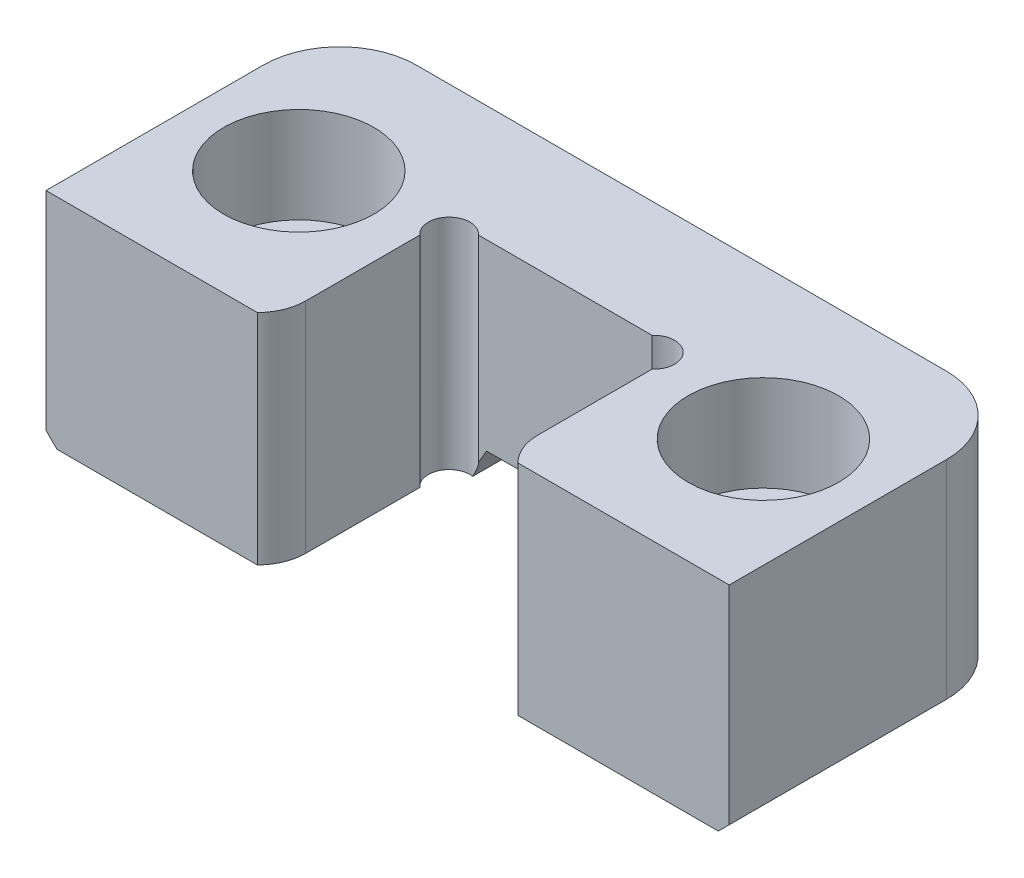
ISO-10303-21;
HEADER;
FILE_DESCRIPTION(('STEP AP214'),'2;1');
FILE_NAME('part.step','',(''),(''),'','','');
FILE_SCHEMA(('AUTOMOTIVE_DESIGN { 1 0 10303 214 1 1 1 1 }'));
ENDSEC;
DATA;
#1=APPLICATION_CONTEXT('core data for automotive mechanical design processes');
#2=APPLICATION_PROTOCOL_DEFINITION('international standard','automotive_design',2000,#1);
#3=PRODUCT_CONTEXT('',#1,'mechanical');
#4=PRODUCT('Part','Part','',(#3));
#5=PRODUCT_RELATED_PRODUCT_CATEGORY('part','',(#4));
#6=PRODUCT_DEFINITION_FORMATION('','',#4);
#7=PRODUCT_DEFINITION_CONTEXT('part definition',#1,'design');
#8=PRODUCT_DEFINITION('design','',#6,#7);
#9=PRODUCT_DEFINITION_SHAPE('','',#8);
#10=(LENGTH_UNIT() NAMED_UNIT(*) SI_UNIT(.MILLI.,.METRE.));
#11=(NAMED_UNIT(*) PLANE_ANGLE_UNIT() SI_UNIT($,.RADIAN.));
#12=(NAMED_UNIT(*) SI_UNIT($,.STERADIAN.) SOLID_ANGLE_UNIT());
#13=UNCERTAINTY_MEASURE_WITH_UNIT(LENGTH_MEASURE(1.E-05),#10,'distance_accuracy_value','');
#14=(GEOMETRIC_REPRESENTATION_CONTEXT(3) GLOBAL_UNCERTAINTY_ASSIGNED_CONTEXT((#13)) GLOBAL_UNIT_ASSIGNED_CONTEXT((#10,
#11,#12)) REPRESENTATION_CONTEXT('',''));
#15=CARTESIAN_POINT('',(0.,0.,0.));
#16=DIRECTION('',(0.,0.,1.));
#17=DIRECTION('',(1.,0.,0.));
#18=AXIS2_PLACEMENT_3D('',#15,#16,#17);
#19=CARTESIAN_POINT('',(-25.,-16.,-21.5));
#20=DIRECTION('',(0.,-1.,0.));
#21=DIRECTION('',(0.,0.,-1.));
#22=AXIS2_PLACEMENT_3D('',#19,#20,#21);
#23=PLANE('',#22);
#24=CARTESIAN_POINT('',(-17.,-16.,-10.5));
#25=DIRECTION('',(0.,1.,0.));
#26=DIRECTION('',(0.,0.,1.));
#27=AXIS2_PLACEMENT_3D('',#24,#25,#26);
#28=CIRCLE('',#27,3.3);
#29=CARTESIAN_POINT('',(-17.,-16.,-7.2));
#30=VERTEX_POINT('',#29);
#31=EDGE_CURVE('E203',#30,#30,#28,.T.);
#32=ORIENTED_EDGE('',*,*,#31,.T.);
#33=EDGE_LOOP('',(#32));
#34=FACE_BOUND('',#33,.T.);
#35=CARTESIAN_POINT('',(-19.4,-16.,-15.9));
#36=DIRECTION('',(0.,-1.,0.));
#37=DIRECTION('',(0.,0.,-1.));
#38=AXIS2_PLACEMENT_3D('',#35,#36,#37);
#39=CIRCLE('',#38,4.8);
#40=CARTESIAN_POINT('',(-24.2,-16.,-15.9));
#41=VERTEX_POINT('',#40);
#42=CARTESIAN_POINT('',(-19.4,-16.,-20.7));
#43=VERTEX_POINT('',#42);
#44=EDGE_CURVE('E344',#41,#43,#39,.T.);
#45=ORIENTED_EDGE('',*,*,#44,.T.);
#46=DIRECTION('',(1.,0.,0.));
#47=VECTOR('',#46,1.);
#48=CARTESIAN_POINT('',(-25.,-16.,-20.7));
#49=LINE('',#48,#47);
#50=CARTESIAN_POINT('',(-7.2679869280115,-16.,-20.7));
#51=VERTEX_POINT('',#50);
#52=EDGE_CURVE('E346',#43,#51,#49,.T.);
#53=ORIENTED_EDGE('',*,*,#52,.T.);
#54=DIRECTION('',(0.,0.,-1.));
#55=VECTOR('',#54,1.);
#56=CARTESIAN_POINT('',(-7.2679869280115,-16.,0.));
#57=LINE('',#56,#55);
#58=CARTESIAN_POINT('',(-7.2679869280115,-16.,-13.4938461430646));
#59=VERTEX_POINT('',#58);
#60=EDGE_CURVE('E223',#59,#51,#57,.T.);
#61=ORIENTED_EDGE('',*,*,#60,.F.);
#62=CARTESIAN_POINT('',(-7.489,-16.,-11.99));
#63=DIRECTION('',(0.,1.,0.));
#64=DIRECTION('',(0.,0.,1.));
#65=AXIS2_PLACEMENT_3D('',#62,#63,#64);
#66=CIRCLE('',#65,1.52);
#67=CARTESIAN_POINT('',(-8.499,-16.,-10.8540862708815));
#68=VERTEX_POINT('',#67);
#69=EDGE_CURVE('E242',#59,#68,#66,.T.);
#70=ORIENTED_EDGE('',*,*,#69,.T.);
#71=DIRECTION('',(0.,0.,-1.));
#72=VECTOR('',#71,1.);
#73=CARTESIAN_POINT('',(-8.499,-16.,0.));
#74=LINE('',#73,#72);
#75=CARTESIAN_POINT('',(-8.499,-16.,-2.5));
#76=VERTEX_POINT('',#75);
#77=EDGE_CURVE('E275',#76,#68,#74,.T.);
#78=ORIENTED_EDGE('',*,*,#77,.F.);
#79=CARTESIAN_POINT('',(-12.0293105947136,-16.,-2.5));
#80=DIRECTION('',(0.,-1.,0.));
#81=DIRECTION('',(0.,0.,1.));
#82=AXIS2_PLACEMENT_3D('',#79,#80,#81);
#83=CIRCLE('',#82,3.53031059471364);
#84=CARTESIAN_POINT('',(-9.53670294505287,-16.,0.));
#85=VERTEX_POINT('',#84);
#86=EDGE_CURVE('E251',#76,#85,#83,.T.);
#87=ORIENTED_EDGE('',*,*,#86,.T.);
#88=DIRECTION('',(1.,0.,0.));
#89=VECTOR('',#88,1.);
#90=CARTESIAN_POINT('',(-25.,-16.,0.));
#91=LINE('',#90,#89);
#92=CARTESIAN_POINT('',(-24.2,-16.,0.));
#93=VERTEX_POINT('',#92);
#94=EDGE_CURVE('E273',#93,#85,#91,.T.);
#95=ORIENTED_EDGE('',*,*,#94,.F.);
#96=DIRECTION('',(0.,0.,-1.));
#97=VECTOR('',#96,1.);
#98=CARTESIAN_POINT('',(-24.2,-16.,-21.5));
#99=LINE('',#98,#97);
#100=EDGE_CURVE('E342',#93,#41,#99,.T.);
#101=ORIENTED_EDGE('',*,*,#100,.T.);
#102=EDGE_LOOP('',(#45,#53,#61,#70,#78,#87,#95,#101));
#103=FACE_BOUND('',#102,.T.);
#104=ADVANCED_FACE('F35',(#34,#103),#23,.T.);
#105=CARTESIAN_POINT('',(-25.,-16.,0.));
#106=DIRECTION('',(-1.,0.,0.));
#107=DIRECTION('',(0.,0.,1.));
#108=AXIS2_PLACEMENT_3D('',#105,#106,#107);
#109=PLANE('',#108);
#110=DIRECTION('',(0.,1.,0.));
#111=VECTOR('',#110,1.);
#112=CARTESIAN_POINT('',(-25.,-16.,-15.9));
#113=LINE('',#112,#111);
#114=CARTESIAN_POINT('',(-25.,0.,-15.9));
#115=VERTEX_POINT('',#114);
#116=CARTESIAN_POINT('',(-25.,-15.2,-15.9));
#117=VERTEX_POINT('',#116);
#118=EDGE_CURVE('E318',#115,#117,#113,.F.);
#119=ORIENTED_EDGE('',*,*,#118,.T.);
#120=DIRECTION('',(0.,0.,1.));
#121=VECTOR('',#120,1.);
#122=CARTESIAN_POINT('',(-25.,-15.2,0.));
#123=LINE('',#122,#121);
#124=CARTESIAN_POINT('',(-25.,-15.2,0.));
#125=VERTEX_POINT('',#124);
#126=EDGE_CURVE('E351',#117,#125,#123,.T.);
#127=ORIENTED_EDGE('',*,*,#126,.T.);
#128=DIRECTION('',(0.,1.,0.));
#129=VECTOR('',#128,1.);
#130=CARTESIAN_POINT('',(-25.,-16.,0.));
#131=LINE('',#130,#129);
#132=CARTESIAN_POINT('',(-25.,0.,0.));
#133=VERTEX_POINT('',#132);
#134=EDGE_CURVE('E283',#125,#133,#131,.T.);
#135=ORIENTED_EDGE('',*,*,#134,.T.);
#136=DIRECTION('',(0.,0.,1.));
#137=VECTOR('',#136,1.);
#138=CARTESIAN_POINT('',(-25.,0.,0.));
#139=LINE('',#138,#137);
#140=EDGE_CURVE('E265',#115,#133,#139,.T.);
#141=ORIENTED_EDGE('',*,*,#140,.F.);
#142=EDGE_LOOP('',(#119,#127,#135,#141));
#143=FACE_BOUND('',#142,.T.);
#144=ADVANCED_FACE('F431',(#143),#109,.T.);
#145=CARTESIAN_POINT('',(-25.,-16.,-21.5));
#146=DIRECTION('',(0.,0.,-1.));
#147=DIRECTION('',(-1.,0.,0.));
#148=AXIS2_PLACEMENT_3D('',#145,#146,#147);
#149=PLANE('',#148);
#150=DIRECTION('',(0.499999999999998,0.86602540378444,0.));
#151=VECTOR('',#150,1.);
#152=CARTESIAN_POINT('',(-6.35,-14.41,-21.5));
#153=LINE('',#152,#151);
#154=CARTESIAN_POINT('',(-6.8061067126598,-15.2,-21.5));
#155=VERTEX_POINT('',#154);
#156=CARTESIAN_POINT('',(-6.35,-14.41,-21.5));
#157=VERTEX_POINT('',#156);
#158=EDGE_CURVE('E190',#155,#157,#153,.T.);
#159=ORIENTED_EDGE('',*,*,#158,.F.);
#160=DIRECTION('',(-1.,0.,0.));
#161=VECTOR('',#160,1.);
#162=CARTESIAN_POINT('',(-25.,-15.2,-21.5));
#163=LINE('',#162,#161);
#164=CARTESIAN_POINT('',(-19.4,-15.2,-21.5));
#165=VERTEX_POINT('',#164);
#166=EDGE_CURVE('E340',#155,#165,#163,.T.);
#167=ORIENTED_EDGE('',*,*,#166,.T.);
#168=DIRECTION('',(0.,1.,0.));
#169=VECTOR('',#168,1.);
#170=CARTESIAN_POINT('',(-19.4,-16.,-21.5));
#171=LINE('',#170,#169);
#172=CARTESIAN_POINT('',(-19.4,0.,-21.5));
#173=VERTEX_POINT('',#172);
#174=EDGE_CURVE('E313',#165,#173,#171,.T.);
#175=ORIENTED_EDGE('',*,*,#174,.T.);
#176=DIRECTION('',(-1.,0.,0.));
#177=VECTOR('',#176,1.);
#178=CARTESIAN_POINT('',(-25.,0.,-21.5));
#179=LINE('',#178,#177);
#180=CARTESIAN_POINT('',(19.4,0.,-21.5));
#181=VERTEX_POINT('',#180);
#182=EDGE_CURVE('E276',#181,#173,#179,.T.);
#183=ORIENTED_EDGE('',*,*,#182,.F.);
#184=DIRECTION('',(0.,1.,0.));
#185=VECTOR('',#184,1.);
#186=CARTESIAN_POINT('',(19.4,-16.,-21.5));
#187=LINE('',#186,#185);
#188=CARTESIAN_POINT('',(19.4,-15.2,-21.5));
#189=VERTEX_POINT('',#188);
#190=EDGE_CURVE('E315',#181,#189,#187,.F.);
#191=ORIENTED_EDGE('',*,*,#190,.T.);
#192=DIRECTION('',(-1.,0.,0.));
#193=VECTOR('',#192,1.);
#194=CARTESIAN_POINT('',(-25.,-15.2,-21.5));
#195=LINE('',#194,#193);
#196=CARTESIAN_POINT('',(6.8061067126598,-15.2,-21.5));
#197=VERTEX_POINT('',#196);
#198=EDGE_CURVE('E338',#189,#197,#195,.T.);
#199=ORIENTED_EDGE('',*,*,#198,.T.);
#200=DIRECTION('',(0.499999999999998,-0.86602540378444,0.));
#201=VECTOR('',#200,1.);
#202=CARTESIAN_POINT('',(6.35,-14.41,-21.5));
#203=LINE('',#202,#201);
#204=CARTESIAN_POINT('',(6.35,-14.41,-21.5));
#205=VERTEX_POINT('',#204);
#206=EDGE_CURVE('E214',#205,#197,#203,.T.);
#207=ORIENTED_EDGE('',*,*,#206,.F.);
#208=DIRECTION('',(1.,0.,0.));
#209=VECTOR('',#208,1.);
#210=CARTESIAN_POINT('',(6.35,-14.41,-21.5));
#211=LINE('',#210,#209);
#212=EDGE_CURVE('E202',#157,#205,#211,.T.);
#213=ORIENTED_EDGE('',*,*,#212,.F.);
#214=EDGE_LOOP('',(#159,#167,#175,#183,#191,#199,#207,#213));
#215=FACE_BOUND('',#214,.T.);
#216=ADVANCED_FACE('F216',(#215),#149,.T.);
#217=CARTESIAN_POINT('',(25.,-16.,0.));
#218=DIRECTION('',(1.,0.,0.));
#219=DIRECTION('',(0.,0.,-1.));
#220=AXIS2_PLACEMENT_3D('',#217,#218,#219);
#221=PLANE('',#220);
#222=DIRECTION('',(0.,1.,0.));
#223=VECTOR('',#222,1.);
#224=CARTESIAN_POINT('',(25.,-16.,0.));
#225=LINE('',#224,#223);
#226=CARTESIAN_POINT('',(25.,-15.2,0.));
#227=VERTEX_POINT('',#226);
#228=CARTESIAN_POINT('',(25.,0.,0.));
#229=VERTEX_POINT('',#228);
#230=EDGE_CURVE('E304',#227,#229,#225,.T.);
#231=ORIENTED_EDGE('',*,*,#230,.F.);
#232=DIRECTION('',(0.,0.,-1.));
#233=VECTOR('',#232,1.);
#234=CARTESIAN_POINT('',(25.,-15.2,0.));
#235=LINE('',#234,#233);
#236=CARTESIAN_POINT('',(25.,-15.2,-15.9));
#237=VERTEX_POINT('',#236);
#238=EDGE_CURVE('E44',#227,#237,#235,.T.);
#239=ORIENTED_EDGE('',*,*,#238,.T.);
#240=DIRECTION('',(0.,1.,0.));
#241=VECTOR('',#240,1.);
#242=CARTESIAN_POINT('',(25.,-16.,-15.9));
#243=LINE('',#242,#241);
#244=CARTESIAN_POINT('',(25.,0.,-15.9));
#245=VERTEX_POINT('',#244);
#246=EDGE_CURVE('E306',#237,#245,#243,.T.);
#247=ORIENTED_EDGE('',*,*,#246,.T.);
#248=DIRECTION('',(0.,0.,-1.));
#249=VECTOR('',#248,1.);
#250=CARTESIAN_POINT('',(25.,0.,0.));
#251=LINE('',#250,#249);
#252=EDGE_CURVE('E299',#229,#245,#251,.T.);
#253=ORIENTED_EDGE('',*,*,#252,.F.);
#254=EDGE_LOOP('',(#231,#239,#247,#253));
#255=FACE_BOUND('',#254,.T.);
#256=ADVANCED_FACE('F423',(#255),#221,.T.);
#257=CARTESIAN_POINT('',(8.499,-16.,0.));
#258=DIRECTION('',(0.,0.,1.));
#259=DIRECTION('',(1.,0.,0.));
#260=AXIS2_PLACEMENT_3D('',#257,#258,#259);
#261=PLANE('',#260);
#262=DIRECTION('',(1.,0.,0.));
#263=VECTOR('',#262,1.);
#264=CARTESIAN_POINT('',(8.499,-16.,0.));
#265=LINE('',#264,#263);
#266=CARTESIAN_POINT('',(9.53670294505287,-16.,0.));
#267=VERTEX_POINT('',#266);
#268=CARTESIAN_POINT('',(24.2,-16.,0.));
#269=VERTEX_POINT('',#268);
#270=EDGE_CURVE('E281',#267,#269,#265,.T.);
#271=ORIENTED_EDGE('',*,*,#270,.T.);
#272=DIRECTION('',(-0.707106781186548,-0.707106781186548,0.));
#273=VECTOR('',#272,1.);
#274=CARTESIAN_POINT('',(16.3495,-23.8505,0.));
#275=LINE('',#274,#273);
#276=EDGE_CURVE('E11',#269,#227,#275,.F.);
#277=ORIENTED_EDGE('',*,*,#276,.T.);
#278=ORIENTED_EDGE('',*,*,#230,.T.);
#279=DIRECTION('',(1.,0.,0.));
#280=VECTOR('',#279,1.);
#281=CARTESIAN_POINT('',(8.499,0.,0.));
#282=LINE('',#281,#280);
#283=CARTESIAN_POINT('',(9.53670294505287,0.,0.));
#284=VERTEX_POINT('',#283);
#285=EDGE_CURVE('E296',#284,#229,#282,.T.);
#286=ORIENTED_EDGE('',*,*,#285,.F.);
#287=DIRECTION('',(0.,1.,0.));
#288=VECTOR('',#287,1.);
#289=CARTESIAN_POINT('',(9.53670294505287,-16.,0.));
#290=LINE('',#289,#288);
#291=EDGE_CURVE('E269',#267,#284,#290,.T.);
#292=ORIENTED_EDGE('',*,*,#291,.F.);
#293=EDGE_LOOP('',(#271,#277,#278,#286,#292));
#294=FACE_BOUND('',#293,.T.);
#295=ADVANCED_FACE('F389',(#294),#261,.T.);
#296=CARTESIAN_POINT('',(8.499,-16.,0.));
#297=DIRECTION('',(-1.,0.,0.));
#298=DIRECTION('',(0.,0.,1.));
#299=AXIS2_PLACEMENT_3D('',#296,#297,#298);
#300=PLANE('',#299);
#301=DIRECTION('',(0.,1.,0.));
#302=VECTOR('',#301,1.);
#303=CARTESIAN_POINT('',(8.499,-16.,-10.8540862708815));
#304=LINE('',#303,#302);
#305=CARTESIAN_POINT('',(8.499,-16.,-10.8540862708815));
#306=VERTEX_POINT('',#305);
#307=CARTESIAN_POINT('',(8.499,0.,-10.8540862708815));
#308=VERTEX_POINT('',#307);
#309=EDGE_CURVE('E239',#306,#308,#304,.T.);
#310=ORIENTED_EDGE('',*,*,#309,.F.);
#311=DIRECTION('',(0.,0.,1.));
#312=VECTOR('',#311,1.);
#313=CARTESIAN_POINT('',(8.499,-16.,0.));
#314=LINE('',#313,#312);
#315=CARTESIAN_POINT('',(8.499,-16.,-2.5));
#316=VERTEX_POINT('',#315);
#317=EDGE_CURVE('E279',#306,#316,#314,.T.);
#318=ORIENTED_EDGE('',*,*,#317,.T.);
#319=DIRECTION('',(0.,1.,0.));
#320=VECTOR('',#319,1.);
#321=CARTESIAN_POINT('',(8.499,-16.,-2.5));
#322=LINE('',#321,#320);
#323=CARTESIAN_POINT('',(8.499,0.,-2.5));
#324=VERTEX_POINT('',#323);
#325=EDGE_CURVE('E266',#316,#324,#322,.T.);
#326=ORIENTED_EDGE('',*,*,#325,.T.);
#327=DIRECTION('',(0.,0.,1.));
#328=VECTOR('',#327,1.);
#329=CARTESIAN_POINT('',(8.499,0.,0.));
#330=LINE('',#329,#328);
#331=EDGE_CURVE('E294',#308,#324,#330,.T.);
#332=ORIENTED_EDGE('',*,*,#331,.F.);
#333=EDGE_LOOP('',(#310,#318,#326,#332));
#334=FACE_BOUND('',#333,.T.);
#335=ADVANCED_FACE('F401',(#334),#300,.T.);
#336=CARTESIAN_POINT('',(-8.499,-16.,-13.));
#337=DIRECTION('',(0.,0.,1.));
#338=DIRECTION('',(1.,0.,0.));
#339=AXIS2_PLACEMENT_3D('',#336,#337,#338);
#340=PLANE('',#339);
#341=DIRECTION('',(-0.499999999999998,-0.86602540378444,0.));
#342=VECTOR('',#341,1.);
#343=CARTESIAN_POINT('',(-7.57574019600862,-16.5330442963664,-13.));
#344=LINE('',#343,#342);
#345=CARTESIAN_POINT('',(-5.76213795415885,-13.3917930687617,-13.));
#346=VERTEX_POINT('',#345);
#347=CARTESIAN_POINT('',(-6.35308627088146,-14.4153455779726,-13.));
#348=VERTEX_POINT('',#347);
#349=EDGE_CURVE('E231',#346,#348,#344,.T.);
#350=ORIENTED_EDGE('',*,*,#349,.F.);
#351=DIRECTION('',(1.,0.,0.));
#352=VECTOR('',#351,1.);
#353=CARTESIAN_POINT('',(6.35,-13.3917930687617,-13.));
#354=LINE('',#353,#352);
#355=CARTESIAN_POINT('',(5.76213795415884,-13.3917930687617,-13.));
#356=VERTEX_POINT('',#355);
#357=EDGE_CURVE('E331',#346,#356,#354,.T.);
#358=ORIENTED_EDGE('',*,*,#357,.T.);
#359=DIRECTION('',(-0.499999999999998,0.86602540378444,0.));
#360=VECTOR('',#359,1.);
#361=CARTESIAN_POINT('',(3.32624019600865,-9.17269438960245,-13.));
#362=LINE('',#361,#360);
#363=CARTESIAN_POINT('',(6.35308627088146,-14.4153455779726,-13.));
#364=VERTEX_POINT('',#363);
#365=EDGE_CURVE('E225',#364,#356,#362,.T.);
#366=ORIENTED_EDGE('',*,*,#365,.F.);
#367=DIRECTION('',(0.,1.,0.));
#368=VECTOR('',#367,1.);
#369=CARTESIAN_POINT('',(6.35308627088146,-16.,-13.));
#370=LINE('',#369,#368);
#371=CARTESIAN_POINT('',(6.35308627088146,0.,-13.));
#372=VERTEX_POINT('',#371);
#373=EDGE_CURVE('E236',#372,#364,#370,.F.);
#374=ORIENTED_EDGE('',*,*,#373,.F.);
#375=DIRECTION('',(1.,0.,0.));
#376=VECTOR('',#375,1.);
#377=CARTESIAN_POINT('',(-8.499,0.,-13.));
#378=LINE('',#377,#376);
#379=CARTESIAN_POINT('',(-6.35308627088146,0.,-13.));
#380=VERTEX_POINT('',#379);
#381=EDGE_CURVE('E291',#380,#372,#378,.T.);
#382=ORIENTED_EDGE('',*,*,#381,.F.);
#383=DIRECTION('',(0.,1.,0.));
#384=VECTOR('',#383,1.);
#385=CARTESIAN_POINT('',(-6.35308627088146,-16.,-13.));
#386=LINE('',#385,#384);
#387=EDGE_CURVE('E248',#348,#380,#386,.T.);
#388=ORIENTED_EDGE('',*,*,#387,.F.);
#389=EDGE_LOOP('',(#350,#358,#366,#374,#382,#388));
#390=FACE_BOUND('',#389,.T.);
#391=ADVANCED_FACE('F410',(#390),#340,.T.);
#392=CARTESIAN_POINT('',(-8.499,-16.,0.));
#393=DIRECTION('',(1.,0.,0.));
#394=DIRECTION('',(0.,0.,-1.));
#395=AXIS2_PLACEMENT_3D('',#392,#393,#394);
#396=PLANE('',#395);
#397=DIRECTION('',(0.,1.,0.));
#398=VECTOR('',#397,1.);
#399=CARTESIAN_POINT('',(-8.499,-16.,-10.8540862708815));
#400=LINE('',#399,#398);
#401=CARTESIAN_POINT('',(-8.499,0.,-10.8540862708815));
#402=VERTEX_POINT('',#401);
#403=EDGE_CURVE('E244',#402,#68,#400,.F.);
#404=ORIENTED_EDGE('',*,*,#403,.F.);
#405=DIRECTION('',(0.,0.,-1.));
#406=VECTOR('',#405,1.);
#407=CARTESIAN_POINT('',(-8.499,0.,0.));
#408=LINE('',#407,#406);
#409=CARTESIAN_POINT('',(-8.499,0.,-2.5));
#410=VERTEX_POINT('',#409);
#411=EDGE_CURVE('E288',#410,#402,#408,.T.);
#412=ORIENTED_EDGE('',*,*,#411,.F.);
#413=DIRECTION('',(0.,1.,0.));
#414=VECTOR('',#413,1.);
#415=CARTESIAN_POINT('',(-8.499,-16.,-2.5));
#416=LINE('',#415,#414);
#417=EDGE_CURVE('E263',#76,#410,#416,.T.);
#418=ORIENTED_EDGE('',*,*,#417,.F.);
#419=ORIENTED_EDGE('',*,*,#77,.T.);
#420=EDGE_LOOP('',(#404,#412,#418,#419));
#421=FACE_BOUND('',#420,.T.);
#422=ADVANCED_FACE('F454',(#421),#396,.T.);
#423=CARTESIAN_POINT('',(-25.,-16.,0.));
#424=DIRECTION('',(0.,0.,1.));
#425=DIRECTION('',(1.,0.,0.));
#426=AXIS2_PLACEMENT_3D('',#423,#424,#425);
#427=PLANE('',#426);
#428=ORIENTED_EDGE('',*,*,#134,.F.);
#429=DIRECTION('',(-0.707106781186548,0.707106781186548,0.));
#430=VECTOR('',#429,1.);
#431=CARTESIAN_POINT('',(-24.6,-15.6,0.));
#432=LINE('',#431,#430);
#433=EDGE_CURVE('E353',#125,#93,#432,.F.);
#434=ORIENTED_EDGE('',*,*,#433,.T.);
#435=ORIENTED_EDGE('',*,*,#94,.T.);
#436=DIRECTION('',(0.,1.,0.));
#437=VECTOR('',#436,1.);
#438=CARTESIAN_POINT('',(-9.53670294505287,-16.,0.));
#439=LINE('',#438,#437);
#440=CARTESIAN_POINT('',(-9.53670294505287,0.,0.));
#441=VERTEX_POINT('',#440);
#442=EDGE_CURVE('E258',#85,#441,#439,.T.);
#443=ORIENTED_EDGE('',*,*,#442,.T.);
#444=DIRECTION('',(1.,0.,0.));
#445=VECTOR('',#444,1.);
#446=CARTESIAN_POINT('',(-25.,0.,0.));
#447=LINE('',#446,#445);
#448=EDGE_CURVE('E286',#133,#441,#447,.T.);
#449=ORIENTED_EDGE('',*,*,#448,.F.);
#450=EDGE_LOOP('',(#428,#434,#435,#443,#449));
#451=FACE_BOUND('',#450,.T.);
#452=ADVANCED_FACE('F463',(#451),#427,.T.);
#453=CARTESIAN_POINT('',(17.,-16.,-10.5));
#454=DIRECTION('',(0.,1.,0.));
#455=DIRECTION('',(0.,0.,1.));
#456=AXIS2_PLACEMENT_3D('',#453,#454,#455);
#457=CIRCLE('',#456,3.3);
#458=CARTESIAN_POINT('',(17.,-16.,-7.2));
#459=VERTEX_POINT('',#458);
#460=EDGE_CURVE('E499',#459,#459,#457,.T.);
#461=ORIENTED_EDGE('',*,*,#460,.T.);
#462=EDGE_LOOP('',(#461));
#463=FACE_BOUND('',#462,.T.);
#464=DIRECTION('',(0.,0.,-1.));
#465=VECTOR('',#464,1.);
#466=CARTESIAN_POINT('',(7.2679869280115,-16.,0.));
#467=LINE('',#466,#465);
#468=CARTESIAN_POINT('',(7.2679869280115,-16.,-13.4938461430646));
#469=VERTEX_POINT('',#468);
#470=CARTESIAN_POINT('',(7.2679869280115,-16.,-20.7));
#471=VERTEX_POINT('',#470);
#472=EDGE_CURVE('E226',#469,#471,#467,.T.);
#473=ORIENTED_EDGE('',*,*,#472,.T.);
#474=DIRECTION('',(1.,0.,0.));
#475=VECTOR('',#474,1.);
#476=CARTESIAN_POINT('',(-25.,-16.,-20.7));
#477=LINE('',#476,#475);
#478=CARTESIAN_POINT('',(19.4,-16.,-20.7));
#479=VERTEX_POINT('',#478);
#480=EDGE_CURVE('E361',#471,#479,#477,.T.);
#481=ORIENTED_EDGE('',*,*,#480,.T.);
#482=CARTESIAN_POINT('',(19.4,-16.,-15.9));
#483=DIRECTION('',(0.,-1.,0.));
#484=DIRECTION('',(0.,0.,-1.));
#485=AXIS2_PLACEMENT_3D('',#482,#483,#484);
#486=CIRCLE('',#485,4.8);
#487=CARTESIAN_POINT('',(24.2,-16.,-15.9));
#488=VERTEX_POINT('',#487);
#489=EDGE_CURVE('E359',#479,#488,#486,.T.);
#490=ORIENTED_EDGE('',*,*,#489,.T.);
#491=DIRECTION('',(0.,0.,1.));
#492=VECTOR('',#491,1.);
#493=CARTESIAN_POINT('',(24.2,-16.,-21.5));
#494=LINE('',#493,#492);
#495=EDGE_CURVE('E357',#488,#269,#494,.T.);
#496=ORIENTED_EDGE('',*,*,#495,.T.);
#497=ORIENTED_EDGE('',*,*,#270,.F.);
#498=CARTESIAN_POINT('',(12.0293105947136,-16.,-2.5));
#499=DIRECTION('',(0.,-1.,0.));
#500=DIRECTION('',(0.,0.,-1.));
#501=AXIS2_PLACEMENT_3D('',#498,#499,#500);
#502=CIRCLE('',#501,3.53031059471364);
#503=EDGE_CURVE('E254',#267,#316,#502,.T.);
#504=ORIENTED_EDGE('',*,*,#503,.T.);
#505=ORIENTED_EDGE('',*,*,#317,.F.);
#506=CARTESIAN_POINT('',(7.489,-16.,-11.99));
#507=DIRECTION('',(0.,1.,0.));
#508=DIRECTION('',(0.,0.,-1.));
#509=AXIS2_PLACEMENT_3D('',#506,#507,#508);
#510=CIRCLE('',#509,1.52);
#511=EDGE_CURVE('E233',#306,#469,#510,.T.);
#512=ORIENTED_EDGE('',*,*,#511,.T.);
#513=EDGE_LOOP('',(#473,#481,#490,#496,#497,#504,#505,#512));
#514=FACE_BOUND('',#513,.T.);
#515=ADVANCED_FACE('F387',(#463,#514),#23,.T.);
#516=CARTESIAN_POINT('',(-25.,0.,-21.5));
#517=DIRECTION('',(0.,-1.,0.));
#518=DIRECTION('',(0.,0.,-1.));
#519=AXIS2_PLACEMENT_3D('',#516,#517,#518);
#520=PLANE('',#519);
#521=CARTESIAN_POINT('',(17.,0.,-10.5));
#522=DIRECTION('',(0.,1.,0.));
#523=DIRECTION('',(0.,0.,1.));
#524=AXIS2_PLACEMENT_3D('',#521,#522,#523);
#525=CIRCLE('',#524,5.49999999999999);
#526=CARTESIAN_POINT('',(17.,0.,-5.));
#527=VERTEX_POINT('',#526);
#528=EDGE_CURVE('E370',#527,#527,#525,.T.);
#529=ORIENTED_EDGE('',*,*,#528,.F.);
#530=EDGE_LOOP('',(#529));
#531=FACE_BOUND('',#530,.T.);
#532=CARTESIAN_POINT('',(-17.,0.,-10.5));
#533=DIRECTION('',(0.,1.,0.));
#534=DIRECTION('',(0.,0.,1.));
#535=AXIS2_PLACEMENT_3D('',#532,#533,#534);
#536=CIRCLE('',#535,5.49999999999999);
#537=CARTESIAN_POINT('',(-17.,0.,-5.));
#538=VERTEX_POINT('',#537);
#539=EDGE_CURVE('E501',#538,#538,#536,.T.);
#540=ORIENTED_EDGE('',*,*,#539,.F.);
#541=EDGE_LOOP('',(#540));
#542=FACE_BOUND('',#541,.T.);
#543=ORIENTED_EDGE('',*,*,#381,.T.);
#544=CARTESIAN_POINT('',(7.489,0.,-11.99));
#545=DIRECTION('',(0.,-1.,0.));
#546=DIRECTION('',(0.,0.,-1.));
#547=AXIS2_PLACEMENT_3D('',#544,#545,#546);
#548=CIRCLE('',#547,1.52);
#549=EDGE_CURVE('E321',#372,#308,#548,.T.);
#550=ORIENTED_EDGE('',*,*,#549,.T.);
#551=ORIENTED_EDGE('',*,*,#331,.T.);
#552=CARTESIAN_POINT('',(12.0293105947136,0.,-2.5));
#553=DIRECTION('',(0.,-1.,0.));
#554=DIRECTION('',(0.,0.,-1.));
#555=AXIS2_PLACEMENT_3D('',#552,#553,#554);
#556=CIRCLE('',#555,3.53031059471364);
#557=EDGE_CURVE('E255',#284,#324,#556,.T.);
#558=ORIENTED_EDGE('',*,*,#557,.F.);
#559=ORIENTED_EDGE('',*,*,#285,.T.);
#560=ORIENTED_EDGE('',*,*,#252,.T.);
#561=CARTESIAN_POINT('',(19.4,0.,-15.9));
#562=DIRECTION('',(0.,-1.,0.));
#563=DIRECTION('',(0.,0.,-1.));
#564=AXIS2_PLACEMENT_3D('',#561,#562,#563);
#565=CIRCLE('',#564,5.6);
#566=EDGE_CURVE('E311',#245,#181,#565,.F.);
#567=ORIENTED_EDGE('',*,*,#566,.T.);
#568=ORIENTED_EDGE('',*,*,#182,.T.);
#569=CARTESIAN_POINT('',(-19.4,0.,-15.9));
#570=DIRECTION('',(0.,-1.,0.));
#571=DIRECTION('',(0.,0.,-1.));
#572=AXIS2_PLACEMENT_3D('',#569,#570,#571);
#573=CIRCLE('',#572,5.6);
#574=EDGE_CURVE('E309',#173,#115,#573,.F.);
#575=ORIENTED_EDGE('',*,*,#574,.T.);
#576=ORIENTED_EDGE('',*,*,#140,.T.);
#577=ORIENTED_EDGE('',*,*,#448,.T.);
#578=CARTESIAN_POINT('',(-12.0293105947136,0.,-2.5));
#579=DIRECTION('',(0.,-1.,0.));
#580=DIRECTION('',(0.,0.,1.));
#581=AXIS2_PLACEMENT_3D('',#578,#579,#580);
#582=CIRCLE('',#581,3.53031059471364);
#583=EDGE_CURVE('E250',#410,#441,#582,.T.);
#584=ORIENTED_EDGE('',*,*,#583,.F.);
#585=ORIENTED_EDGE('',*,*,#411,.T.);
#586=CARTESIAN_POINT('',(-7.489,0.,-11.99));
#587=DIRECTION('',(0.,1.,0.));
#588=DIRECTION('',(0.,0.,1.));
#589=AXIS2_PLACEMENT_3D('',#586,#587,#588);
#590=CIRCLE('',#589,1.52);
#591=EDGE_CURVE('E241',#380,#402,#590,.T.);
#592=ORIENTED_EDGE('',*,*,#591,.F.);
#593=EDGE_LOOP('',(#543,#550,#551,#558,#559,#560,#567,#568,#575,#576,#577,#584,#585,#592));
#594=FACE_BOUND('',#593,.T.);
#595=ADVANCED_FACE('F396',(#531,#542,#594),#520,.F.);
#596=CARTESIAN_POINT('',(19.4,-16.,-15.9));
#597=DIRECTION('',(0.,1.,0.));
#598=DIRECTION('',(0.,0.,1.));
#599=AXIS2_PLACEMENT_3D('',#596,#597,#598);
#600=CYLINDRICAL_SURFACE('',#599,5.6);
#601=ORIENTED_EDGE('',*,*,#246,.F.);
#602=CARTESIAN_POINT('',(19.4,-15.2,-15.9));
#603=DIRECTION('',(0.,-1.,0.));
#604=DIRECTION('',(0.,0.,-1.));
#605=AXIS2_PLACEMENT_3D('',#602,#603,#604);
#606=CIRCLE('',#605,5.6);
#607=EDGE_CURVE('E363',#237,#189,#606,.F.);
#608=ORIENTED_EDGE('',*,*,#607,.T.);
#609=ORIENTED_EDGE('',*,*,#190,.F.);
#610=ORIENTED_EDGE('',*,*,#566,.F.);
#611=EDGE_LOOP('',(#601,#608,#609,#610));
#612=FACE_BOUND('',#611,.T.);
#613=ADVANCED_FACE('F422',(#612),#600,.T.);
#614=CARTESIAN_POINT('',(-19.4,-16.,-15.9));
#615=DIRECTION('',(0.,1.,0.));
#616=DIRECTION('',(0.,0.,1.));
#617=AXIS2_PLACEMENT_3D('',#614,#615,#616);
#618=CYLINDRICAL_SURFACE('',#617,5.6);
#619=ORIENTED_EDGE('',*,*,#174,.F.);
#620=CARTESIAN_POINT('',(-19.4,-15.2,-15.9));
#621=DIRECTION('',(0.,-1.,0.));
#622=DIRECTION('',(0.,0.,-1.));
#623=AXIS2_PLACEMENT_3D('',#620,#621,#622);
#624=CIRCLE('',#623,5.6);
#625=EDGE_CURVE('E349',#165,#117,#624,.F.);
#626=ORIENTED_EDGE('',*,*,#625,.T.);
#627=ORIENTED_EDGE('',*,*,#118,.F.);
#628=ORIENTED_EDGE('',*,*,#574,.F.);
#629=EDGE_LOOP('',(#619,#626,#627,#628));
#630=FACE_BOUND('',#629,.T.);
#631=ADVANCED_FACE('F434',(#630),#618,.T.);
#632=CARTESIAN_POINT('',(12.0293105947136,-16.,-2.5));
#633=DIRECTION('',(0.,1.,0.));
#634=DIRECTION('',(0.,0.,1.));
#635=AXIS2_PLACEMENT_3D('',#632,#633,#634);
#636=CYLINDRICAL_SURFACE('',#635,3.53031059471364);
#637=ORIENTED_EDGE('',*,*,#557,.T.);
#638=ORIENTED_EDGE('',*,*,#325,.F.);
#639=ORIENTED_EDGE('',*,*,#503,.F.);
#640=ORIENTED_EDGE('',*,*,#291,.T.);
#641=EDGE_LOOP('',(#637,#638,#639,#640));
#642=FACE_BOUND('',#641,.T.);
#643=ADVANCED_FACE('F393',(#642),#636,.T.);
#644=CARTESIAN_POINT('',(-12.0293105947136,-16.,-2.5));
#645=DIRECTION('',(0.,1.,0.));
#646=DIRECTION('',(0.,0.,1.));
#647=AXIS2_PLACEMENT_3D('',#644,#645,#646);
#648=CYLINDRICAL_SURFACE('',#647,3.53031059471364);
#649=ORIENTED_EDGE('',*,*,#583,.T.);
#650=ORIENTED_EDGE('',*,*,#442,.F.);
#651=ORIENTED_EDGE('',*,*,#86,.F.);
#652=ORIENTED_EDGE('',*,*,#417,.T.);
#653=EDGE_LOOP('',(#649,#650,#651,#652));
#654=FACE_BOUND('',#653,.T.);
#655=ADVANCED_FACE('F461',(#654),#648,.T.);
#656=CARTESIAN_POINT('',(-7.489,-16.,-11.99));
#657=DIRECTION('',(0.,1.,0.));
#658=DIRECTION('',(0.,0.,1.));
#659=AXIS2_PLACEMENT_3D('',#656,#657,#658);
#660=CYLINDRICAL_SURFACE('',#659,1.52);
#661=ORIENTED_EDGE('',*,*,#69,.F.);
#662=CARTESIAN_POINT('',(-7.489,-16.382805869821,-11.99));
#663=DIRECTION('',(-0.86602540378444,0.499999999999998,0.));
#664=DIRECTION('',(0.499999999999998,0.86602540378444,0.));
#665=AXIS2_PLACEMENT_3D('',#662,#663,#664);
#666=ELLIPSE('',#665,3.04000000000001,1.52);
#667=EDGE_CURVE('E327',#59,#348,#666,.F.);
#668=ORIENTED_EDGE('',*,*,#667,.T.);
#669=ORIENTED_EDGE('',*,*,#387,.T.);
#670=ORIENTED_EDGE('',*,*,#591,.T.);
#671=ORIENTED_EDGE('',*,*,#403,.T.);
#672=EDGE_LOOP('',(#661,#668,#669,#670,#671));
#673=FACE_BOUND('',#672,.T.);
#674=ADVANCED_FACE('F448',(#673),#660,.F.);
#675=CARTESIAN_POINT('',(7.489,-16.,-11.99));
#676=DIRECTION('',(0.,1.,0.));
#677=DIRECTION('',(0.,0.,1.));
#678=AXIS2_PLACEMENT_3D('',#675,#676,#677);
#679=CYLINDRICAL_SURFACE('',#678,1.52);
#680=ORIENTED_EDGE('',*,*,#373,.T.);
#681=CARTESIAN_POINT('',(7.489,-16.382805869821,-11.99));
#682=DIRECTION('',(0.86602540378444,0.499999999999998,0.));
#683=DIRECTION('',(-0.499999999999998,0.86602540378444,0.));
#684=AXIS2_PLACEMENT_3D('',#681,#682,#683);
#685=ELLIPSE('',#684,3.04000000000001,1.52);
#686=EDGE_CURVE('E324',#364,#469,#685,.F.);
#687=ORIENTED_EDGE('',*,*,#686,.T.);
#688=ORIENTED_EDGE('',*,*,#511,.F.);
#689=ORIENTED_EDGE('',*,*,#309,.T.);
#690=ORIENTED_EDGE('',*,*,#549,.F.);
#691=EDGE_LOOP('',(#680,#687,#688,#689,#690));
#692=FACE_BOUND('',#691,.T.);
#693=ADVANCED_FACE('F404',(#692),#679,.F.);
#694=CARTESIAN_POINT('',(-6.35,-14.41,0.));
#695=DIRECTION('',(-0.86602540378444,0.499999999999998,0.));
#696=DIRECTION('',(-0.499999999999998,-0.86602540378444,0.));
#697=AXIS2_PLACEMENT_3D('',#694,#695,#696);
#698=PLANE('',#697);
#699=ORIENTED_EDGE('',*,*,#60,.T.);
#700=DIRECTION('',(-0.377964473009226,-0.654653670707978,0.654653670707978));
#701=VECTOR('',#700,1.);
#702=CARTESIAN_POINT('',(-9.40523432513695,-19.7018210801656,-16.9981789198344));
#703=LINE('',#702,#701);
#704=EDGE_CURVE('E197',#51,#155,#703,.F.);
#705=ORIENTED_EDGE('',*,*,#704,.T.);
#706=ORIENTED_EDGE('',*,*,#158,.T.);
#707=DIRECTION('',(0.,0.,-1.));
#708=VECTOR('',#707,1.);
#709=CARTESIAN_POINT('',(-6.35,-14.41,0.));
#710=LINE('',#709,#708);
#711=CARTESIAN_POINT('',(-6.35,-14.41,-16.8000000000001));
#712=VERTEX_POINT('',#711);
#713=EDGE_CURVE('E195',#712,#157,#710,.T.);
#714=ORIENTED_EDGE('',*,*,#713,.F.);
#715=DIRECTION('',(0.147788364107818,0.255976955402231,0.955319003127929));
#716=VECTOR('',#715,1.);
#717=CARTESIAN_POINT('',(-3.97809145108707,-10.3017338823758,-1.4677421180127));
#718=LINE('',#717,#716);
#719=EDGE_CURVE('E334',#712,#346,#718,.T.);
#720=ORIENTED_EDGE('',*,*,#719,.T.);
#721=ORIENTED_EDGE('',*,*,#349,.T.);
#722=ORIENTED_EDGE('',*,*,#667,.F.);
#723=EDGE_LOOP('',(#699,#705,#706,#714,#720,#721,#722));
#724=FACE_BOUND('',#723,.T.);
#725=ADVANCED_FACE('F193',(#724),#698,.F.);
#726=CARTESIAN_POINT('',(6.35,-14.41,0.));
#727=DIRECTION('',(0.86602540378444,0.499999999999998,0.));
#728=DIRECTION('',(-0.499999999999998,0.86602540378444,0.));
#729=AXIS2_PLACEMENT_3D('',#726,#727,#728);
#730=PLANE('',#729);
#731=ORIENTED_EDGE('',*,*,#206,.T.);
#732=DIRECTION('',(-0.377964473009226,0.654653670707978,-0.654653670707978));
#733=VECTOR('',#732,1.);
#734=CARTESIAN_POINT('',(2.26237718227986,-7.33002959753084,-29.3699704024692));
#735=LINE('',#734,#733);
#736=EDGE_CURVE('E355',#197,#471,#735,.F.);
#737=ORIENTED_EDGE('',*,*,#736,.T.);
#738=ORIENTED_EDGE('',*,*,#472,.F.);
#739=ORIENTED_EDGE('',*,*,#686,.F.);
#740=ORIENTED_EDGE('',*,*,#365,.T.);
#741=DIRECTION('',(0.147788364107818,-0.255976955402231,-0.955319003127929));
#742=VECTOR('',#741,1.);
#743=CARTESIAN_POINT('',(3.97809145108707,-10.3017338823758,-1.4677421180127));
#744=LINE('',#743,#742);
#745=CARTESIAN_POINT('',(6.35,-14.41,-16.8000000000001));
#746=VERTEX_POINT('',#745);
#747=EDGE_CURVE('E336',#356,#746,#744,.T.);
#748=ORIENTED_EDGE('',*,*,#747,.T.);
#749=DIRECTION('',(0.,0.,-1.));
#750=VECTOR('',#749,1.);
#751=CARTESIAN_POINT('',(6.35,-14.41,0.));
#752=LINE('',#751,#750);
#753=EDGE_CURVE('E213',#746,#205,#752,.T.);
#754=ORIENTED_EDGE('',*,*,#753,.T.);
#755=EDGE_LOOP('',(#731,#737,#738,#739,#740,#748,#754));
#756=FACE_BOUND('',#755,.T.);
#757=ADVANCED_FACE('F408',(#756),#730,.F.);
#758=CARTESIAN_POINT('',(6.35,-14.41,0.));
#759=DIRECTION('',(0.,1.,0.));
#760=DIRECTION('',(0.,0.,1.));
#761=AXIS2_PLACEMENT_3D('',#758,#759,#760);
#762=PLANE('',#761);
#763=ORIENTED_EDGE('',*,*,#753,.F.);
#764=DIRECTION('',(-1.,0.,0.));
#765=VECTOR('',#764,1.);
#766=CARTESIAN_POINT('',(-6.35,-14.41,-16.8000000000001));
#767=LINE('',#766,#765);
#768=EDGE_CURVE('E212',#746,#712,#767,.T.);
#769=ORIENTED_EDGE('',*,*,#768,.T.);
#770=ORIENTED_EDGE('',*,*,#713,.T.);
#771=ORIENTED_EDGE('',*,*,#212,.T.);
#772=EDGE_LOOP('',(#763,#769,#770,#771));
#773=FACE_BOUND('',#772,.T.);
#774=ADVANCED_FACE('F209',(#773),#762,.F.);
#775=CARTESIAN_POINT('',(6.35,-14.41,-16.8000000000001));
#776=DIRECTION('',(0.,-0.965925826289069,0.258819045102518));
#777=DIRECTION('',(0.,-0.258819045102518,-0.965925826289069));
#778=AXIS2_PLACEMENT_3D('',#775,#776,#777);
#779=PLANE('',#778);
#780=ORIENTED_EDGE('',*,*,#747,.F.);
#781=ORIENTED_EDGE('',*,*,#357,.F.);
#782=ORIENTED_EDGE('',*,*,#719,.F.);
#783=ORIENTED_EDGE('',*,*,#768,.F.);
#784=EDGE_LOOP('',(#780,#781,#782,#783));
#785=FACE_BOUND('',#784,.T.);
#786=ADVANCED_FACE('F416',(#785),#779,.T.);
#787=CARTESIAN_POINT('',(-17.,0.,-10.5));
#788=DIRECTION('',(0.,1.,0.));
#789=DIRECTION('',(0.,0.,1.));
#790=AXIS2_PLACEMENT_3D('',#787,#788,#789);
#791=CYLINDRICAL_SURFACE('',#790,3.3);
#792=ORIENTED_EDGE('',*,*,#31,.F.);
#793=EDGE_LOOP('',(#792));
#794=FACE_BOUND('',#793,.T.);
#795=CARTESIAN_POINT('',(-17.,-7.,-10.5));
#796=DIRECTION('',(0.,1.,0.));
#797=DIRECTION('',(0.,0.,1.));
#798=AXIS2_PLACEMENT_3D('',#795,#796,#797);
#799=CIRCLE('',#798,3.3);
#800=CARTESIAN_POINT('',(-17.,-7.,-7.2));
#801=VERTEX_POINT('',#800);
#802=EDGE_CURVE('E514',#801,#801,#799,.T.);
#803=ORIENTED_EDGE('',*,*,#802,.T.);
#804=EDGE_LOOP('',(#803));
#805=FACE_BOUND('',#804,.T.);
#806=ADVANCED_FACE('F518',(#794,#805),#791,.F.);
#807=CARTESIAN_POINT('',(-13.7,-7.,-10.5));
#808=DIRECTION('',(0.,-1.,0.));
#809=DIRECTION('',(0.,0.,-1.));
#810=AXIS2_PLACEMENT_3D('',#807,#808,#809);
#811=PLANE('',#810);
#812=ORIENTED_EDGE('',*,*,#802,.F.);
#813=EDGE_LOOP('',(#812));
#814=FACE_BOUND('',#813,.T.);
#815=CARTESIAN_POINT('',(-17.,-7.,-10.5));
#816=DIRECTION('',(0.,1.,0.));
#817=DIRECTION('',(0.,0.,1.));
#818=AXIS2_PLACEMENT_3D('',#815,#816,#817);
#819=CIRCLE('',#818,5.49999999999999);
#820=CARTESIAN_POINT('',(-17.,-7.,-5.00000000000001));
#821=VERTEX_POINT('',#820);
#822=EDGE_CURVE('E505',#821,#821,#819,.T.);
#823=ORIENTED_EDGE('',*,*,#822,.T.);
#824=EDGE_LOOP('',(#823));
#825=FACE_BOUND('',#824,.T.);
#826=ADVANCED_FACE('F521',(#814,#825),#811,.F.);
#827=CARTESIAN_POINT('',(-17.,0.,-10.5));
#828=DIRECTION('',(0.,1.,0.));
#829=DIRECTION('',(0.,0.,1.));
#830=AXIS2_PLACEMENT_3D('',#827,#828,#829);
#831=CYLINDRICAL_SURFACE('',#830,5.49999999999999);
#832=ORIENTED_EDGE('',*,*,#822,.F.);
#833=EDGE_LOOP('',(#832));
#834=FACE_BOUND('',#833,.T.);
#835=ORIENTED_EDGE('',*,*,#539,.T.);
#836=EDGE_LOOP('',(#835));
#837=FACE_BOUND('',#836,.T.);
#838=ADVANCED_FACE('F527',(#834,#837),#831,.F.);
#839=CARTESIAN_POINT('',(17.,0.,-10.5));
#840=DIRECTION('',(0.,1.,0.));
#841=DIRECTION('',(0.,0.,1.));
#842=AXIS2_PLACEMENT_3D('',#839,#840,#841);
#843=CYLINDRICAL_SURFACE('',#842,3.3);
#844=ORIENTED_EDGE('',*,*,#460,.F.);
#845=EDGE_LOOP('',(#844));
#846=FACE_BOUND('',#845,.T.);
#847=CARTESIAN_POINT('',(17.,-7.,-10.5));
#848=DIRECTION('',(0.,1.,0.));
#849=DIRECTION('',(0.,0.,1.));
#850=AXIS2_PLACEMENT_3D('',#847,#848,#849);
#851=CIRCLE('',#850,3.3);
#852=CARTESIAN_POINT('',(17.,-7.,-7.2));
#853=VERTEX_POINT('',#852);
#854=EDGE_CURVE('E502',#853,#853,#851,.T.);
#855=ORIENTED_EDGE('',*,*,#854,.T.);
#856=EDGE_LOOP('',(#855));
#857=FACE_BOUND('',#856,.T.);
#858=ADVANCED_FACE('F533',(#846,#857),#843,.F.);
#859=CARTESIAN_POINT('',(20.3,-7.,-10.5));
#860=DIRECTION('',(0.,-1.,0.));
#861=DIRECTION('',(0.,0.,-1.));
#862=AXIS2_PLACEMENT_3D('',#859,#860,#861);
#863=PLANE('',#862);
#864=ORIENTED_EDGE('',*,*,#854,.F.);
#865=EDGE_LOOP('',(#864));
#866=FACE_BOUND('',#865,.T.);
#867=CARTESIAN_POINT('',(17.,-7.,-10.5));
#868=DIRECTION('',(0.,1.,0.));
#869=DIRECTION('',(0.,0.,1.));
#870=AXIS2_PLACEMENT_3D('',#867,#868,#869);
#871=CIRCLE('',#870,5.49999999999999);
#872=CARTESIAN_POINT('',(17.,-7.,-5.00000000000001));
#873=VERTEX_POINT('',#872);
#874=EDGE_CURVE('E508',#873,#873,#871,.T.);
#875=ORIENTED_EDGE('',*,*,#874,.T.);
#876=EDGE_LOOP('',(#875));
#877=FACE_BOUND('',#876,.T.);
#878=ADVANCED_FACE('F475',(#866,#877),#863,.F.);
#879=CARTESIAN_POINT('',(17.,0.,-10.5));
#880=DIRECTION('',(0.,1.,0.));
#881=DIRECTION('',(0.,0.,1.));
#882=AXIS2_PLACEMENT_3D('',#879,#880,#881);
#883=CYLINDRICAL_SURFACE('',#882,5.49999999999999);
#884=ORIENTED_EDGE('',*,*,#874,.F.);
#885=EDGE_LOOP('',(#884));
#886=FACE_BOUND('',#885,.T.);
#887=ORIENTED_EDGE('',*,*,#528,.T.);
#888=EDGE_LOOP('',(#887));
#889=FACE_BOUND('',#888,.T.);
#890=ADVANCED_FACE('F468',(#886,#889),#883,.F.);
#891=CARTESIAN_POINT('',(-25.,-15.2,0.));
#892=DIRECTION('',(0.707106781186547,0.707106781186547,0.));
#893=DIRECTION('',(0.,0.,1.));
#894=AXIS2_PLACEMENT_3D('',#891,#892,#893);
#895=PLANE('',#894);
#896=ORIENTED_EDGE('',*,*,#433,.F.);
#897=ORIENTED_EDGE('',*,*,#126,.F.);
#898=DIRECTION('',(-0.707106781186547,0.707106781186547,0.));
#899=VECTOR('',#898,1.);
#900=CARTESIAN_POINT('',(-24.2,-16.,-15.9));
#901=LINE('',#900,#899);
#902=EDGE_CURVE('E368',#41,#117,#901,.T.);
#903=ORIENTED_EDGE('',*,*,#902,.F.);
#904=ORIENTED_EDGE('',*,*,#100,.F.);
#905=EDGE_LOOP('',(#896,#897,#903,#904));
#906=FACE_BOUND('',#905,.T.);
#907=ADVANCED_FACE('F466',(#906),#895,.F.);
#908=CARTESIAN_POINT('',(-19.4,-16.,-15.9));
#909=DIRECTION('',(0.,1.,0.));
#910=DIRECTION('',(0.,0.,1.));
#911=AXIS2_PLACEMENT_3D('',#908,#909,#910);
#912=CONICAL_SURFACE('',#911,4.8,0.785398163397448);
#913=ORIENTED_EDGE('',*,*,#902,.T.);
#914=ORIENTED_EDGE('',*,*,#625,.F.);
#915=DIRECTION('',(0.,0.707106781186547,-0.707106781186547));
#916=VECTOR('',#915,1.);
#917=CARTESIAN_POINT('',(-19.4,-16.,-20.7));
#918=LINE('',#917,#916);
#919=EDGE_CURVE('E366',#43,#165,#918,.T.);
#920=ORIENTED_EDGE('',*,*,#919,.F.);
#921=ORIENTED_EDGE('',*,*,#44,.F.);
#922=EDGE_LOOP('',(#913,#914,#920,#921));
#923=FACE_BOUND('',#922,.T.);
#924=ADVANCED_FACE('F438',(#923),#912,.T.);
#925=CARTESIAN_POINT('',(-25.,-15.2,-21.5));
#926=DIRECTION('',(0.,0.707106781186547,0.707106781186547));
#927=DIRECTION('',(-1.,0.,0.));
#928=AXIS2_PLACEMENT_3D('',#925,#926,#927);
#929=PLANE('',#928);
#930=ORIENTED_EDGE('',*,*,#704,.F.);
#931=ORIENTED_EDGE('',*,*,#52,.F.);
#932=ORIENTED_EDGE('',*,*,#919,.T.);
#933=ORIENTED_EDGE('',*,*,#166,.F.);
#934=EDGE_LOOP('',(#930,#931,#932,#933));
#935=FACE_BOUND('',#934,.T.);
#936=ADVANCED_FACE('F442',(#935),#929,.F.);
#937=CARTESIAN_POINT('',(25.,-15.2,0.));
#938=DIRECTION('',(-0.707106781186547,0.707106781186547,0.));
#939=DIRECTION('',(0.,0.,-1.));
#940=AXIS2_PLACEMENT_3D('',#937,#938,#939);
#941=PLANE('',#940);
#942=ORIENTED_EDGE('',*,*,#276,.F.);
#943=ORIENTED_EDGE('',*,*,#495,.F.);
#944=DIRECTION('',(-0.707106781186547,-0.707106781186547,0.));
#945=VECTOR('',#944,1.);
#946=CARTESIAN_POINT('',(25.,-15.2,-15.9));
#947=LINE('',#946,#945);
#948=EDGE_CURVE('E39',#237,#488,#947,.T.);
#949=ORIENTED_EDGE('',*,*,#948,.F.);
#950=ORIENTED_EDGE('',*,*,#238,.F.);
#951=EDGE_LOOP('',(#942,#943,#949,#950));
#952=FACE_BOUND('',#951,.T.);
#953=ADVANCED_FACE('F37',(#952),#941,.F.);
#954=CARTESIAN_POINT('',(19.4,-16.,-15.9));
#955=DIRECTION('',(0.,1.,0.));
#956=DIRECTION('',(0.,0.,1.));
#957=AXIS2_PLACEMENT_3D('',#954,#955,#956);
#958=CONICAL_SURFACE('',#957,4.8,0.785398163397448);
#959=ORIENTED_EDGE('',*,*,#948,.T.);
#960=ORIENTED_EDGE('',*,*,#489,.F.);
#961=DIRECTION('',(0.,-0.707106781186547,0.707106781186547));
#962=VECTOR('',#961,1.);
#963=CARTESIAN_POINT('',(19.4,-15.2,-21.5));
#964=LINE('',#963,#962);
#965=EDGE_CURVE('E371',#189,#479,#964,.T.);
#966=ORIENTED_EDGE('',*,*,#965,.F.);
#967=ORIENTED_EDGE('',*,*,#607,.F.);
#968=EDGE_LOOP('',(#959,#960,#966,#967));
#969=FACE_BOUND('',#968,.T.);
#970=ADVANCED_FACE('F382',(#969),#958,.T.);
#971=CARTESIAN_POINT('',(-25.,-15.2,-21.5));
#972=DIRECTION('',(0.,0.707106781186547,0.707106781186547));
#973=DIRECTION('',(-1.,0.,0.));
#974=AXIS2_PLACEMENT_3D('',#971,#972,#973);
#975=PLANE('',#974);
#976=ORIENTED_EDGE('',*,*,#965,.T.);
#977=ORIENTED_EDGE('',*,*,#480,.F.);
#978=ORIENTED_EDGE('',*,*,#736,.F.);
#979=ORIENTED_EDGE('',*,*,#198,.F.);
#980=EDGE_LOOP('',(#976,#977,#978,#979));
#981=FACE_BOUND('',#980,.T.);
#982=ADVANCED_FACE('F417',(#981),#975,.F.);
#983=CLOSED_SHELL('',(#104,#144,#216,#256,#295,#335,#391,#422,#452,#515,#595,#613,#631,#643,
#655,#674,#693,#725,#757,#774,#786,#806,#826,#838,#858,#878,#890,#907,#924,#936,#953,#970,#982));
#984=MANIFOLD_SOLID_BREP('B2',#983);
#985=ADVANCED_BREP_SHAPE_REPRESENTATION('',(#18,#984),#14);
#986=SHAPE_DEFINITION_REPRESENTATION(#9,#985);
ENDSEC;
END-ISO-10303-21;
